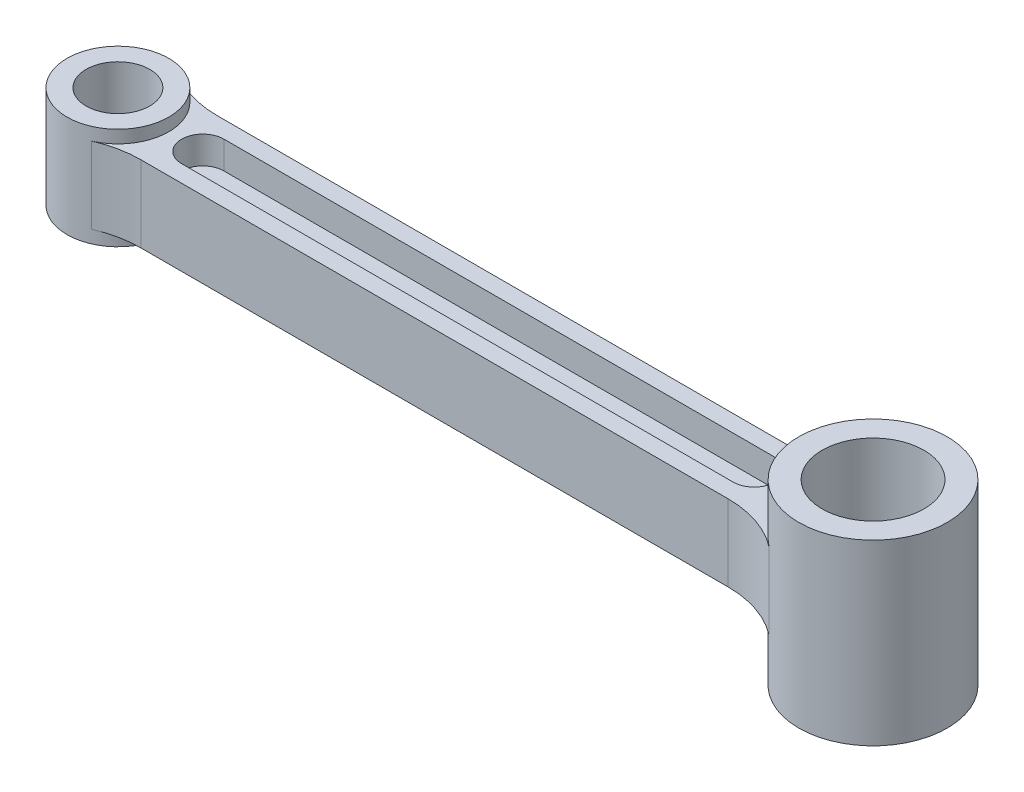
from build123d import *

# Parameters (mm, degrees)
EXTRUDE1_DEPTH     = 9
SKETCH1_3_R        = 17.5
SKETCH1_3_R_2      = 12
EXTRUDE2_DEPTH     = 21
SKETCH1_4_R        = 12
SKETCH1_4_R_2      = 7.5
EXTRUDE3_DEPTH     = 12
FILLET1_R          = 24
CUT_EXTRUDE1_DEPTH = 6.5


with BuildPart() as part:
    # Sketch1 → Extrude1 (new, symmetric)
    with BuildSketch(Plane(origin=(0, 0, 0), x_dir=(1, 0, 0), z_dir=(0, 1, 0))):
        with BuildLine():
            Line((162.99166898, 9), (7.937253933, 9))
            ThreePointArc((7.937253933, 9), (10.937253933, 4.937253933), (12, 0))
            ThreePointArc((12, 0), (10.937253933, -4.937253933), (7.937253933, -9))
            Line((7.937253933, -9), (162.99166898, -9))
            ThreePointArc((162.99166898, -9), (160.5, 0), (162.99166898, 9))
        make_face()
    extrude(amount=EXTRUDE1_DEPTH, both=True)

    # Sketch1_3 → Extrude2 (add, symmetric)
    with BuildSketch(Plane(origin=(0, 0, 0), x_dir=(1, 0, 0), z_dir=(0, 1, 0))):
        with Locations(Location((178, 0, 0), (0, 0, 270))):
            Circle(SKETCH1_3_R)
        with Locations(Location((178, 0, 0), (0, 0, 90))):
            Circle(SKETCH1_3_R_2, mode=Mode.SUBTRACT)
    extrude(amount=EXTRUDE2_DEPTH, both=True)

    # Sketch1_4 → Extrude3 (add, symmetric)
    with BuildSketch(Plane(origin=(0, 0, 0), x_dir=(1, 0, 0), z_dir=(0, 1, 0))):
        with Locations(Location((0, 0, 0), (0, 0, 270))):
            Circle(SKETCH1_4_R)
        with Locations(Location((0, 0, 0), (0, 0, 270))):
            Circle(SKETCH1_4_R_2, mode=Mode.SUBTRACT)
    extrude(amount=EXTRUDE3_DEPTH, both=True)

    # Fillet1
    fillet1_edges = [part.edges().sort_by_distance(p)[0] for p in [
        (162.99166898, 0, 9),
        (7.937253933, 0, 9),
        (7.937253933, 0, -9),
        (162.99166898, 0, -9),
    ]]
    fillet(fillet1_edges, radius=FILLET1_R)

    # Sketch2 → Cut-Extrude1 (cut)
    with BuildSketch(Plane(origin=(0, 9, 0), x_dir=(-1, 0, 0), z_dir=(0, 1, 0))):
        with BuildLine():
            Line((-150, -5), (-20, -5))
            ThreePointArc((-20, -5), (-15, 0), (-20, 5))
            Line((-20, 5), (-150, 5))
            ThreePointArc((-150, 5), (-155, 0), (-150, -5))
        make_face()
    cut_extrude1 = extrude(amount=-CUT_EXTRUDE1_DEPTH, mode=Mode.SUBTRACT)

    # Mirror1: Cut-Extrude1 across plane
    add(cut_extrude1.mirror(Plane.ZX), mode=Mode.SUBTRACT)


solid = part.part
